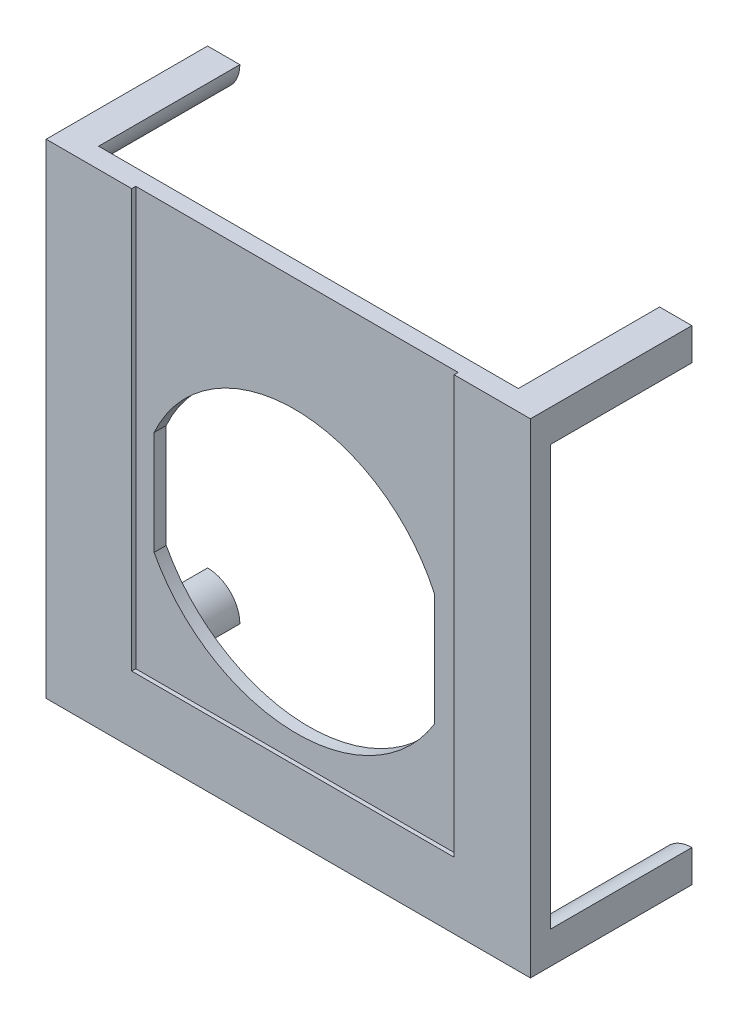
from build123d import *

# Parameters (mm, degrees)
SKETCH_1_W          = 60
SKETCH_1_H          = 60
EXTRUDE_1_DEPTH     = 2.5
CUT_EXTRUDE_1_DEPTH = 3
SKETCH_3_W          = 39.937606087
SKETCH_3_H          = 51.769268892
CUT_EXTRUDE_2_DEPTH = 0.5
CUT_EXTRUDE_3_DEPTH = 0.5
EXTRUDE_2_DEPTH     = 17.5


with BuildPart() as part:
    # Sketch 1 → Extrude 1 (new body)
    with BuildSketch(Plane.XY):
        Rectangle(SKETCH_1_W, SKETCH_1_H)
    extrude(amount=EXTRUDE_1_DEPTH)

    # Sketch 2 → Cut-Extrude 1 (cut)
    with BuildSketch(Plane.XY.offset(2.5)):
        with BuildLine():
            Line((-17.127460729, 4.717071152), (-17.127460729, -8.149977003))
            ThreePointArc((-17.127460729, -8.149977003), (-0.038819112, -18.750768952), (17.632861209, -9.153364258))
            Line((17.632861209, -9.153364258), (17.632861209, 4.717071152))
            ThreePointArc((17.632861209, 4.717071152), (0.25270024, 15.926380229), (-17.127460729, 4.717071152))
        make_face()
    extrude(amount=-CUT_EXTRUDE_1_DEPTH, mode=Mode.SUBTRACT)

    # Sketch 3 → Cut-Extrude 2 (cut)
    with BuildSketch(Plane.XY.offset(2.5)):
        with Locations((0.572875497, 4.115365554)):
            Rectangle(SKETCH_3_W, SKETCH_3_H)
    extrude(amount=-CUT_EXTRUDE_2_DEPTH, mode=Mode.SUBTRACT)

    # Sketch 4 → Cut-Extrude 3 (cut)
    with BuildSketch(Plane(origin=(0, 0, 0), x_dir=(-1, 0, 0), z_dir=(0, 0, -1))):
        with BuildLine():
            Line((-22.792861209, -0.773214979), (-22.792861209, -8.756937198))
            ThreePointArc((-22.792861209, -8.756937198), (-0.110308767, -25.175073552), (22.288995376, -8.372557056))
            Line((22.288995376, -8.372557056), (22.288995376, -0.773214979))
            ThreePointArc((22.288995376, -0.773214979), (-0.251932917, 21.767713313), (-22.792861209, -0.773214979))
        make_face()
    extrude(amount=-CUT_EXTRUDE_3_DEPTH, mode=Mode.SUBTRACT)

    # Sketch 5 → Extrude 2 (add)
    with BuildSketch(Plane(origin=(0, 0, 0), x_dir=(-1, 0, 0), z_dir=(0, 0, -1))):
        with BuildLine():
            Line((-30, 26), (-30, 30))
            Line((-30, 30), (-26, 30))
            ThreePointArc((-26, 30), (-27.171572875, 27.171572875), (-30, 26))
        make_face()
        with BuildLine():
            Line((26, 30), (30, 30))
            Line((30, 30), (30, 26))
            ThreePointArc((30, 26), (27.171572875, 27.171572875), (26, 30))
        make_face()
        with BuildLine():
            Line((30, -26), (30, -30))
            Line((30, -30), (26, -30))
            ThreePointArc((26, -30), (27.171572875, -27.171572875), (30, -26))
        make_face()
        with BuildLine():
            Line((-26, -30), (-30, -30))
            Line((-30, -30), (-30, -26))
            ThreePointArc((-30, -26), (-27.171572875, -27.171572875), (-26, -30))
        make_face()
    extrude(amount=EXTRUDE_2_DEPTH)


solid = part.part
